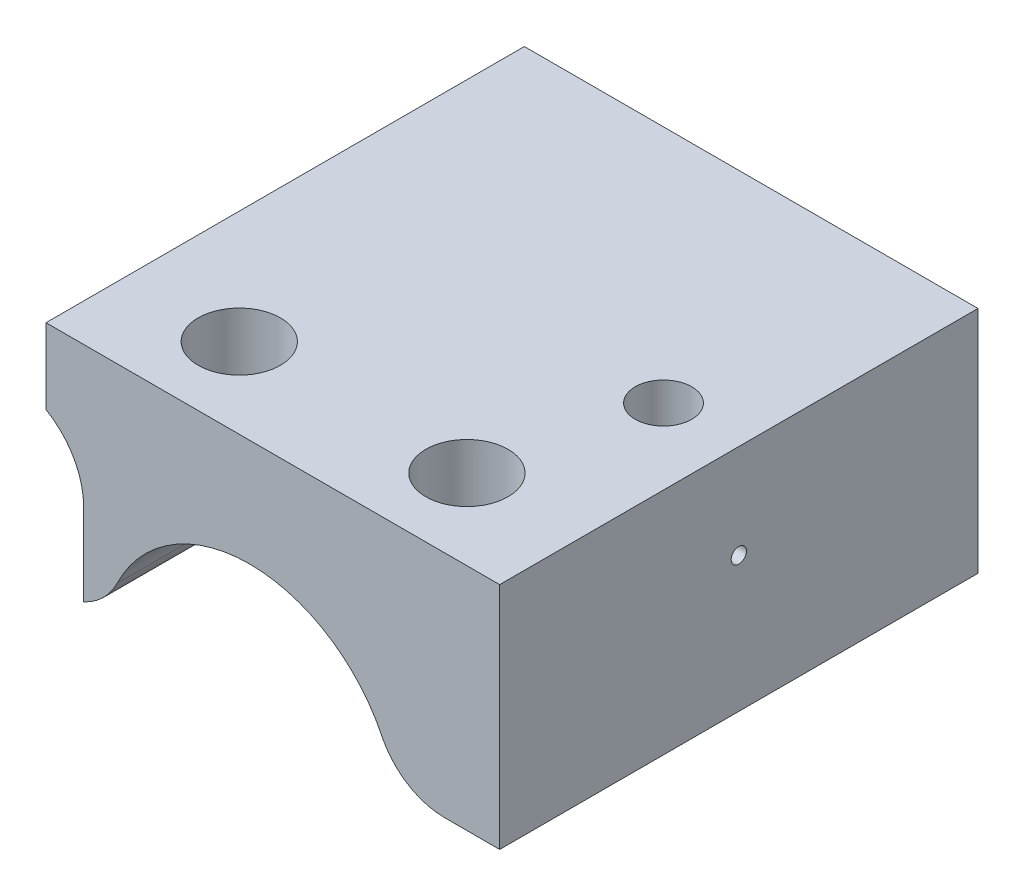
ISO-10303-21;
HEADER;
FILE_DESCRIPTION(('STEP AP214'),'2;1');
FILE_NAME('part.step','',(''),(''),'','','');
FILE_SCHEMA(('AUTOMOTIVE_DESIGN { 1 0 10303 214 1 1 1 1 }'));
ENDSEC;
DATA;
#1=APPLICATION_CONTEXT('core data for automotive mechanical design processes');
#2=APPLICATION_PROTOCOL_DEFINITION('international standard','automotive_design',2000,#1);
#3=PRODUCT_CONTEXT('',#1,'mechanical');
#4=PRODUCT('Part','Part','',(#3));
#5=PRODUCT_RELATED_PRODUCT_CATEGORY('part','',(#4));
#6=PRODUCT_DEFINITION_FORMATION('','',#4);
#7=PRODUCT_DEFINITION_CONTEXT('part definition',#1,'design');
#8=PRODUCT_DEFINITION('design','',#6,#7);
#9=PRODUCT_DEFINITION_SHAPE('','',#8);
#10=(LENGTH_UNIT() NAMED_UNIT(*) SI_UNIT(.MILLI.,.METRE.));
#11=(NAMED_UNIT(*) PLANE_ANGLE_UNIT() SI_UNIT($,.RADIAN.));
#12=(NAMED_UNIT(*) SI_UNIT($,.STERADIAN.) SOLID_ANGLE_UNIT());
#13=UNCERTAINTY_MEASURE_WITH_UNIT(LENGTH_MEASURE(1.E-05),#10,'distance_accuracy_value','');
#14=(GEOMETRIC_REPRESENTATION_CONTEXT(3) GLOBAL_UNCERTAINTY_ASSIGNED_CONTEXT((#13)) GLOBAL_UNIT_ASSIGNED_CONTEXT((#10,
#11,#12)) REPRESENTATION_CONTEXT('',''));
#15=CARTESIAN_POINT('',(0.,0.,0.));
#16=DIRECTION('',(0.,0.,1.));
#17=DIRECTION('',(1.,0.,0.));
#18=AXIS2_PLACEMENT_3D('',#15,#16,#17);
#19=CARTESIAN_POINT('',(-6.40299272,3.01794919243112,6.35));
#20=DIRECTION('',(0.,0.,-1.));
#21=DIRECTION('',(-1.,0.,0.));
#22=AXIS2_PLACEMENT_3D('',#19,#20,#21);
#23=CYLINDRICAL_SURFACE('',#22,2.);
#24=CARTESIAN_POINT('',(-6.40299272,3.01794919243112,-6.35));
#25=DIRECTION('',(0.,0.,-1.));
#26=DIRECTION('',(-1.,0.,0.));
#27=AXIS2_PLACEMENT_3D('',#24,#25,#26);
#28=CIRCLE('',#27,2.);
#29=CARTESIAN_POINT('',(-5.40299272,4.75,-6.35));
#30=VERTEX_POINT('',#29);
#31=CARTESIAN_POINT('',(-4.40299272,3.01794919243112,-6.35));
#32=VERTEX_POINT('',#31);
#33=EDGE_CURVE('E148',#30,#32,#28,.T.);
#34=ORIENTED_EDGE('',*,*,#33,.T.);
#35=DIRECTION('',(0.,0.,-1.));
#36=VECTOR('',#35,1.);
#37=CARTESIAN_POINT('',(-4.40299272,3.01794919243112,6.35));
#38=LINE('',#37,#36);
#39=CARTESIAN_POINT('',(-4.40299272,3.01794919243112,6.35));
#40=VERTEX_POINT('',#39);
#41=EDGE_CURVE('E11',#40,#32,#38,.T.);
#42=ORIENTED_EDGE('',*,*,#41,.F.);
#43=CARTESIAN_POINT('',(-6.40299272,3.01794919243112,6.35));
#44=DIRECTION('',(0.,0.,-1.));
#45=DIRECTION('',(-1.,0.,0.));
#46=AXIS2_PLACEMENT_3D('',#43,#44,#45);
#47=CIRCLE('',#46,2.);
#48=CARTESIAN_POINT('',(-5.40299272,4.75,6.35));
#49=VERTEX_POINT('',#48);
#50=EDGE_CURVE('E167',#49,#40,#47,.T.);
#51=ORIENTED_EDGE('',*,*,#50,.F.);
#52=DIRECTION('',(0.,0.,-1.));
#53=VECTOR('',#52,1.);
#54=CARTESIAN_POINT('',(-5.40299272,4.75,6.35));
#55=LINE('',#54,#53);
#56=EDGE_CURVE('E144',#49,#30,#55,.T.);
#57=ORIENTED_EDGE('',*,*,#56,.T.);
#58=EDGE_LOOP('',(#34,#42,#51,#57));
#59=FACE_BOUND('',#58,.T.);
#60=ADVANCED_FACE('F30',(#59),#23,.F.);
#61=CARTESIAN_POINT('',(-4.40299272,3.01794919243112,6.35));
#62=DIRECTION('',(1.,0.,0.));
#63=DIRECTION('',(0.,0.,-1.));
#64=AXIS2_PLACEMENT_3D('',#61,#62,#63);
#65=PLANE('',#64);
#66=DIRECTION('',(0.,-1.,0.));
#67=VECTOR('',#66,1.);
#68=CARTESIAN_POINT('',(-4.40299272,3.01794919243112,-6.35));
#69=LINE('',#68,#67);
#70=CARTESIAN_POINT('',(-4.40299272,0.830526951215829,-6.35));
#71=VERTEX_POINT('',#70);
#72=EDGE_CURVE('E151',#32,#71,#69,.T.);
#73=ORIENTED_EDGE('',*,*,#72,.T.);
#74=DIRECTION('',(0.,0.,-1.));
#75=VECTOR('',#74,1.);
#76=CARTESIAN_POINT('',(-4.40299272,0.830526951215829,6.35));
#77=LINE('',#76,#75);
#78=CARTESIAN_POINT('',(-4.40299272,0.830526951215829,6.35));
#79=VERTEX_POINT('',#78);
#80=EDGE_CURVE('E42',#79,#71,#77,.T.);
#81=ORIENTED_EDGE('',*,*,#80,.F.);
#82=DIRECTION('',(0.,-1.,0.));
#83=VECTOR('',#82,1.);
#84=CARTESIAN_POINT('',(-4.40299272,3.01794919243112,6.35));
#85=LINE('',#84,#83);
#86=EDGE_CURVE('E102',#40,#79,#85,.T.);
#87=ORIENTED_EDGE('',*,*,#86,.F.);
#88=ORIENTED_EDGE('',*,*,#41,.T.);
#89=EDGE_LOOP('',(#73,#81,#87,#88));
#90=FACE_BOUND('',#89,.T.);
#91=ADVANCED_FACE('F218',(#90),#65,.F.);
#92=CARTESIAN_POINT('',(-5.17879570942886,2.51000000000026,6.35));
#93=DIRECTION('',(0.,0.,-1.));
#94=DIRECTION('',(-1.,0.,0.));
#95=AXIS2_PLACEMENT_3D('',#92,#93,#94);
#96=CYLINDRICAL_SURFACE('',#95,1.85);
#97=CARTESIAN_POINT('',(-5.17879570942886,2.51000000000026,-6.35));
#98=DIRECTION('',(0.,0.,1.));
#99=DIRECTION('',(1.,0.,0.));
#100=AXIS2_PLACEMENT_3D('',#97,#98,#99);
#101=CIRCLE('',#100,1.85);
#102=CARTESIAN_POINT('',(-3.51402211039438,1.70313640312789,-6.35));
#103=VERTEX_POINT('',#102);
#104=EDGE_CURVE('E154',#71,#103,#101,.T.);
#105=ORIENTED_EDGE('',*,*,#104,.T.);
#106=DIRECTION('',(0.,0.,-1.));
#107=VECTOR('',#106,1.);
#108=CARTESIAN_POINT('',(-3.51402211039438,1.70313640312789,6.35));
#109=LINE('',#108,#107);
#110=CARTESIAN_POINT('',(-3.51402211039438,1.70313640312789,6.35));
#111=VERTEX_POINT('',#110);
#112=EDGE_CURVE('E178',#111,#103,#109,.T.);
#113=ORIENTED_EDGE('',*,*,#112,.F.);
#114=CARTESIAN_POINT('',(-5.17879570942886,2.51000000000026,6.35));
#115=DIRECTION('',(0.,0.,1.));
#116=DIRECTION('',(1.,0.,0.));
#117=AXIS2_PLACEMENT_3D('',#114,#115,#116);
#118=CIRCLE('',#117,1.85);
#119=EDGE_CURVE('E233',#79,#111,#118,.T.);
#120=ORIENTED_EDGE('',*,*,#119,.F.);
#121=ORIENTED_EDGE('',*,*,#80,.T.);
#122=EDGE_LOOP('',(#105,#113,#120,#121));
#123=FACE_BOUND('',#122,.T.);
#124=ADVANCED_FACE('F223',(#123),#96,.T.);
#125=CARTESIAN_POINT('',(0.,0.,6.35));
#126=DIRECTION('',(0.,0.,-1.));
#127=DIRECTION('',(-1.,0.,0.));
#128=AXIS2_PLACEMENT_3D('',#125,#126,#127);
#129=CYLINDRICAL_SURFACE('',#128,3.905);
#130=CARTESIAN_POINT('',(-3.49515607,1.74152491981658,4.21875));
#131=CARTESIAN_POINT('',(-3.49515256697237,1.74153330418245,4.24947455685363));
#132=CARTESIAN_POINT('',(-3.49384218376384,1.74416948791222,4.28024758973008));
#133=CARTESIAN_POINT('',(-3.4887451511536,1.75434077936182,4.34079670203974));
#134=CARTESIAN_POINT('',(-3.48495051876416,1.7618916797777,4.37056924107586));
#135=CARTESIAN_POINT('',(-3.47374043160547,1.78391279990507,4.43737537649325));
#136=CARTESIAN_POINT('',(-3.46556790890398,1.79980109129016,4.47380512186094));
#137=CARTESIAN_POINT('',(-3.44641010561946,1.83622145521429,4.54342750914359));
#138=CARTESIAN_POINT('',(-3.43541844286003,1.85676405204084,4.57661256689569));
#139=CARTESIAN_POINT('',(-3.40185804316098,1.91790215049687,4.66454407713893));
#140=CARTESIAN_POINT('',(-3.3769118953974,1.96171547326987,4.71610743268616));
#141=CARTESIAN_POINT('',(-3.32172965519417,2.05379216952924,4.81188727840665));
#142=CARTESIAN_POINT('',(-3.29147696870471,2.10206927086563,4.8560798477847));
#143=CARTESIAN_POINT('',(-3.2319164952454,2.19229201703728,4.93121458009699));
#144=CARTESIAN_POINT('',(-3.20333058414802,2.23390993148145,4.96313055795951));
#145=CARTESIAN_POINT('',(-3.14314849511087,2.31782636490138,5.02300008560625));
#146=CARTESIAN_POINT('',(-3.11155052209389,2.36012527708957,5.05095124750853));
#147=CARTESIAN_POINT('',(-3.01240816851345,2.48714805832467,5.12899966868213));
#148=CARTESIAN_POINT('',(-2.94045327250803,2.57209408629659,5.17336882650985));
#149=CARTESIAN_POINT('',(-2.79702911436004,2.72674180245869,5.23997087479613));
#150=CARTESIAN_POINT('',(-2.72704795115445,2.79684663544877,5.26450104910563));
#151=CARTESIAN_POINT('',(-2.57997573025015,2.93303991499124,5.29914350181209));
#152=CARTESIAN_POINT('',(-2.50289834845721,2.99913569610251,5.30928291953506));
#153=CARTESIAN_POINT('',(-2.36178776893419,3.11081147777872,5.31190237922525));
#154=CARTESIAN_POINT('',(-2.29880109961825,3.15762712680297,5.30788979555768));
#155=CARTESIAN_POINT('',(-2.17136052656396,3.24657111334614,5.28805292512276));
#156=CARTESIAN_POINT('',(-2.10690828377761,3.28870446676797,5.27224142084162));
#157=CARTESIAN_POINT('',(-1.98864986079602,3.36130504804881,5.23095573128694));
#158=CARTESIAN_POINT('',(-1.93470430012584,3.39257334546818,5.20729883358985));
#159=CARTESIAN_POINT('',(-1.82950413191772,3.45044023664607,5.15021594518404));
#160=CARTESIAN_POINT('',(-1.77824866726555,3.47704032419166,5.11679308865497));
#161=CARTESIAN_POINT('',(-1.68046661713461,3.52534417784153,5.04020220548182));
#162=CARTESIAN_POINT('',(-1.63396409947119,3.54702364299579,4.99698783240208));
#163=CARTESIAN_POINT('',(-1.54832867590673,3.58523495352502,4.90183469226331));
#164=CARTESIAN_POINT('',(-1.50919392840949,3.60176808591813,4.84989811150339));
#165=CARTESIAN_POINT('',(-1.44347469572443,3.62857478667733,4.74394341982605));
#166=CARTESIAN_POINT('',(-1.4160757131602,3.63927897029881,4.69053742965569));
#167=CARTESIAN_POINT('',(-1.37027126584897,3.65677273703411,4.57940471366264));
#168=CARTESIAN_POINT('',(-1.35186346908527,3.66356333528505,4.52167911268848));
#169=CARTESIAN_POINT('',(-1.32535254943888,3.67323532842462,4.40598571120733));
#170=CARTESIAN_POINT('',(-1.31687593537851,3.6762587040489,4.34811494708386));
#171=CARTESIAN_POINT('',(-1.30927620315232,3.67897242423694,4.23168648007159));
#172=CARTESIAN_POINT('',(-1.31015228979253,3.67866305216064,4.17312883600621));
#173=CARTESIAN_POINT('',(-1.32117816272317,3.67471712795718,4.05749423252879));
#174=CARTESIAN_POINT('',(-1.33125203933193,3.67110781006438,4.00040907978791));
#175=CARTESIAN_POINT('',(-1.36017963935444,3.660487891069,3.88884303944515));
#176=CARTESIAN_POINT('',(-1.37903297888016,3.65347743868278,3.83436203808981));
#177=CARTESIAN_POINT('',(-1.42483377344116,3.6358593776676,3.72940022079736));
#178=CARTESIAN_POINT('',(-1.45179882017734,3.62524394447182,3.67892840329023));
#179=CARTESIAN_POINT('',(-1.51272877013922,3.60024400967,3.58345190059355));
#180=CARTESIAN_POINT('',(-1.54669352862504,3.58585958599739,3.5384471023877));
#181=CARTESIAN_POINT('',(-1.62091563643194,3.55293250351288,3.45421115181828));
#182=CARTESIAN_POINT('',(-1.66127273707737,3.53432145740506,3.41509486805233));
#183=CARTESIAN_POINT('',(-1.74623160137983,3.49312574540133,3.34429340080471));
#184=CARTESIAN_POINT('',(-1.79083409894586,3.47054039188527,3.31260950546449));
#185=CARTESIAN_POINT('',(-1.88530098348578,3.42018810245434,3.25534063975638));
#186=CARTESIAN_POINT('',(-1.93532043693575,3.39219836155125,3.23020937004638));
#187=CARTESIAN_POINT('',(-2.03656293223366,3.33240144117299,3.18838018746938));
#188=CARTESIAN_POINT('',(-2.08778643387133,3.30059278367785,3.17168555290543));
#189=CARTESIAN_POINT('',(-2.19641862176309,3.22947182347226,3.14461936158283));
#190=CARTESIAN_POINT('',(-2.25379874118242,3.18971866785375,3.13530117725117));
#191=CARTESIAN_POINT('',(-2.36679328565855,3.10680651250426,3.12567411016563));
#192=CARTESIAN_POINT('',(-2.4224065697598,3.06364537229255,3.12537093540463));
#193=CARTESIAN_POINT('',(-2.55798138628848,2.9524193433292,3.134538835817));
#194=CARTESIAN_POINT('',(-2.6362454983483,2.88267432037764,3.1489625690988));
#195=CARTESIAN_POINT('',(-2.78489754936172,2.73936342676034,3.19256643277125));
#196=CARTESIAN_POINT('',(-2.85526312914,2.66578753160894,3.22178722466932));
#197=CARTESIAN_POINT('',(-2.98845832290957,2.5156236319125,3.29358966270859));
#198=CARTESIAN_POINT('',(-3.05112993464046,2.43900526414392,3.33640179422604));
#199=CARTESIAN_POINT('',(-3.1378755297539,2.3248772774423,3.40991115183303));
#200=CARTESIAN_POINT('',(-3.16555549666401,2.28700669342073,3.43593105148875));
#201=CARTESIAN_POINT('',(-3.21846087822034,2.21193039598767,3.49120793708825));
#202=CARTESIAN_POINT('',(-3.2436875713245,2.17472434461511,3.52046321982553));
#203=CARTESIAN_POINT('',(-3.29060218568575,2.10302744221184,3.58125368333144));
#204=CARTESIAN_POINT('',(-3.31239072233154,2.06848742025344,3.61265258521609));
#205=CARTESIAN_POINT('',(-3.35338488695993,2.00134494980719,3.67919858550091));
#206=CARTESIAN_POINT('',(-3.37258576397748,1.96874612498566,3.71435237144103));
#207=CARTESIAN_POINT('',(-3.40812519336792,1.9065679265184,3.7894595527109));
#208=CARTESIAN_POINT('',(-3.42442594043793,1.87703027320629,3.82946630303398));
#209=CARTESIAN_POINT('',(-3.45292868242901,1.82406327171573,3.91468705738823));
#210=CARTESIAN_POINT('',(-3.46514839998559,1.80060761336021,3.9598773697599));
#211=CARTESIAN_POINT('',(-3.47999167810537,1.77167426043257,4.03521092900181));
#212=CARTESIAN_POINT('',(-3.48448875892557,1.76278674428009,4.06365888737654));
#213=CARTESIAN_POINT('',(-3.49123276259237,1.74939338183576,4.1217882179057));
#214=CARTESIAN_POINT('',(-3.49348744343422,1.74487243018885,4.15146496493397));
#215=CARTESIAN_POINT('',(-3.49494280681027,1.74195264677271,4.19376967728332));
#216=CARTESIAN_POINT('',(-3.49515749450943,1.74152151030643,4.20625583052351));
#217=CARTESIAN_POINT('',(-3.49515607,1.74152491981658,4.21875));
#218=B_SPLINE_CURVE_WITH_KNOTS('',3,(#130,#131,#132,#133,#134,#135,#136,#137,#138,#139,#140,
#141,#142,#143,#144,#145,#146,#147,#148,#149,#150,#151,#152,#153,#154,#155,#156,#157,#158,#159,
#160,#161,#162,#163,#164,#165,#166,#167,#168,#169,#170,#171,#172,#173,#174,#175,#176,#177,#178,
#179,#180,#181,#182,#183,#184,#185,#186,#187,#188,#189,#190,#191,#192,#193,#194,#195,#196,#197,
#198,#199,#200,#201,#202,#203,#204,#205,#206,#207,#208,#209,#210,#211,#212,#213,#214,#215,#216,
#217),.UNSPECIFIED.,.T.,.F.,(4,2,2,2,2,2,2,2,2,2,2,2,2,2,2,2,2,2,2,2,2,2,2,2,2,2,2,2,2,2,2,2,2,
2,2,2,2,2,2,2,2,2,2,4),(0.,0.0921286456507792,0.184554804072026,0.305580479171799,
0.42688259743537,0.642036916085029,0.857876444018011,1.03683417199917,1.21589922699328,
1.57362030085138,1.87867658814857,2.18315680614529,2.41802568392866,2.65264048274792,
2.85186575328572,3.05102715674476,3.25115171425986,3.45122618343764,3.63322235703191,
3.8151713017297,3.99003229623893,4.16487842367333,4.33829445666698,4.51170290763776,
4.68549017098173,4.85927384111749,5.03609983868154,5.21295646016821,5.39995068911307,
5.58701752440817,5.79750573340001,6.00812721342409,6.32384497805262,6.64043506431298,
6.96270982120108,7.12351439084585,7.28423470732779,7.43858637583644,7.59321768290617,
7.74973674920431,7.90556698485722,7.99565387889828,8.0854280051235,8.12289220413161),.UNSPECIFIED.);
#219=CARTESIAN_POINT('',(-3.49515607,1.74152491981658,4.21875));
#220=VERTEX_POINT('',#219);
#221=EDGE_CURVE('E262',#220,#220,#218,.T.);
#222=ORIENTED_EDGE('',*,*,#221,.T.);
#223=EDGE_LOOP('',(#222));
#224=FACE_BOUND('',#223,.T.);
#225=DIRECTION('',(0.,0.,-1.));
#226=VECTOR('',#225,1.);
#227=CARTESIAN_POINT('',(3.51402211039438,1.70313640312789,6.35));
#228=LINE('',#227,#226);
#229=CARTESIAN_POINT('',(3.51402211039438,1.70313640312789,3.13401145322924));
#230=VERTEX_POINT('',#229);
#231=CARTESIAN_POINT('',(3.51402211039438,1.70313640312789,-6.35));
#232=VERTEX_POINT('',#231);
#233=EDGE_CURVE('E174',#230,#232,#228,.T.);
#234=ORIENTED_EDGE('',*,*,#233,.F.);
#235=CARTESIAN_POINT('',(3.84882124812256,0.660000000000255,3.14641303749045));
#236=CARTESIAN_POINT('',(3.84107131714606,0.70519351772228,3.14491694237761));
#237=CARTESIAN_POINT('',(3.83252659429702,0.750244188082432,3.14334912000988));
#238=CARTESIAN_POINT('',(3.81385616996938,0.840016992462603,3.14019785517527));
#239=CARTESIAN_POINT('',(3.80373044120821,0.884739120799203,3.13861441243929));
#240=CARTESIAN_POINT('',(3.77096531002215,1.01846766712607,3.13402832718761));
#241=CARTESIAN_POINT('',(3.74595916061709,1.10691263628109,3.13119471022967));
#242=CARTESIAN_POINT('',(3.68947619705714,1.28273208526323,3.12723461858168));
#243=CARTESIAN_POINT('',(3.65793707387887,1.37008696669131,3.12612552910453));
#244=CARTESIAN_POINT('',(3.58874423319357,1.54225059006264,3.12727543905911));
#245=CARTESIAN_POINT('',(3.55109581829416,1.62706146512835,3.12953153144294));
#246=CARTESIAN_POINT('',(3.46415181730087,1.80551403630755,3.14002486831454));
#247=CARTESIAN_POINT('',(3.41396037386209,1.89868097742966,3.14907241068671));
#248=CARTESIAN_POINT('',(3.30702211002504,2.07932037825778,3.17754963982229));
#249=CARTESIAN_POINT('',(3.25029491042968,2.16680870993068,3.19694885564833));
#250=CARTESIAN_POINT('',(3.14427584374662,2.31716106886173,3.24491219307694));
#251=CARTESIAN_POINT('',(3.09580174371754,2.38142585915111,3.27082794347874));
#252=CARTESIAN_POINT('',(2.99804527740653,2.50335956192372,3.33428064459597));
#253=CARTESIAN_POINT('',(2.94876424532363,2.56103830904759,3.37179994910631));
#254=CARTESIAN_POINT('',(2.86612241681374,2.65274821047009,3.44806311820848));
#255=CARTESIAN_POINT('',(2.83214123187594,2.68889809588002,3.48357307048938));
#256=CARTESIAN_POINT('',(2.76730853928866,2.75557270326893,3.56200028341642));
#257=CARTESIAN_POINT('',(2.73645355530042,2.78610370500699,3.60490916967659));
#258=CARTESIAN_POINT('',(2.68422760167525,2.8363821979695,3.6908124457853));
#259=CARTESIAN_POINT('',(2.66212806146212,2.85706194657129,3.73281485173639));
#260=CARTESIAN_POINT('',(2.62300895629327,2.89301863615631,3.82129306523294));
#261=CARTESIAN_POINT('',(2.60598791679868,2.90829714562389,3.86776756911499));
#262=CARTESIAN_POINT('',(2.57813489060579,2.93301869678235,3.96428672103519));
#263=CARTESIAN_POINT('',(2.56733251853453,2.94243383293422,4.01434719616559));
#264=CARTESIAN_POINT('',(2.55287412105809,2.95498797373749,4.11626141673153));
#265=CARTESIAN_POINT('',(2.54921602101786,2.95812880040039,4.16811463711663));
#266=CARTESIAN_POINT('',(2.54932177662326,2.95803658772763,4.26730153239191));
#267=CARTESIAN_POINT('',(2.5524710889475,2.95533131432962,4.31463822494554));
#268=CARTESIAN_POINT('',(2.56474863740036,2.94468243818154,4.40791194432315));
#269=CARTESIAN_POINT('',(2.57387572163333,2.93673984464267,4.45384923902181));
#270=CARTESIAN_POINT('',(2.59745533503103,2.91590358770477,4.54285176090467));
#271=CARTESIAN_POINT('',(2.61187776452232,2.90303789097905,4.58593162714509));
#272=CARTESIAN_POINT('',(2.64520511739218,2.87270271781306,4.6685758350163));
#273=CARTESIAN_POINT('',(2.66411101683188,2.85523223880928,4.70813940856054));
#274=CARTESIAN_POINT('',(2.7071591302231,2.81447339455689,4.78630426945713));
#275=CARTESIAN_POINT('',(2.73160819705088,2.79081903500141,4.82454407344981));
#276=CARTESIAN_POINT('',(2.78333928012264,2.73923108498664,4.89584382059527));
#277=CARTESIAN_POINT('',(2.81062294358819,2.71129500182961,4.9289007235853));
#278=CARTESIAN_POINT('',(2.88126456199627,2.63650232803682,5.00546292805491));
#279=CARTESIAN_POINT('',(2.92570521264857,2.58727770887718,5.04566182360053));
#280=CARTESIAN_POINT('',(3.01524891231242,2.48235385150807,5.11540248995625));
#281=CARTESIAN_POINT('',(3.06035299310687,2.42664332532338,5.14492530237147));
#282=CARTESIAN_POINT('',(3.13822204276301,2.32457546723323,5.18886319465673));
#283=CARTESIAN_POINT('',(3.17130707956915,2.27926261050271,5.20520726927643));
#284=CARTESIAN_POINT('',(3.23608290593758,2.18632285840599,5.23354566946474));
#285=CARTESIAN_POINT('',(3.26777292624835,2.13869471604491,5.24553762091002));
#286=CARTESIAN_POINT('',(3.36042983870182,1.99245026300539,5.27619178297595));
#287=CARTESIAN_POINT('',(3.41864223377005,1.89091765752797,5.289359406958));
#288=CARTESIAN_POINT('',(3.5180648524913,1.69774034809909,5.30494167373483));
#289=CARTESIAN_POINT('',(3.56051651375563,1.60680431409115,5.30864136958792));
#290=CARTESIAN_POINT('',(3.6383596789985,1.42177316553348,5.31164044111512));
#291=CARTESIAN_POINT('',(3.67374283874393,1.3276744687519,5.31093464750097));
#292=CARTESIAN_POINT('',(3.73654944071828,1.13883552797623,5.30724997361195));
#293=CARTESIAN_POINT('',(3.76410736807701,1.04413894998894,5.30431315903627));
#294=CARTESIAN_POINT('',(3.79998338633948,0.900871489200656,5.29945268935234));
#295=CARTESIAN_POINT('',(3.81102376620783,0.852959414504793,5.29775853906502));
#296=CARTESIAN_POINT('',(3.83128778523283,0.756753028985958,5.29437747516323));
#297=CARTESIAN_POINT('',(3.84051144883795,0.708458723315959,5.29269056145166));
#298=CARTESIAN_POINT('',(3.84882124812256,0.660000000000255,5.29108696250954));
#299=B_SPLINE_CURVE_WITH_KNOTS('',3,(#235,#236,#237,#238,#239,#240,#241,#242,#243,#244,#245,
#246,#247,#248,#249,#250,#251,#252,#253,#254,#255,#256,#257,#258,#259,#260,#261,#262,#263,#264,
#265,#266,#267,#268,#269,#270,#271,#272,#273,#274,#275,#276,#277,#278,#279,#280,#281,#282,#283,
#284,#285,#286,#287,#288,#289,#290,#291,#292,#293,#294,#295,#296,#297,#298),.UNSPECIFIED.,.F.,
.F.,(4,2,2,2,2,2,2,2,2,2,2,2,2,2,2,2,2,2,2,2,2,2,2,2,2,2,2,2,2,2,2,4),(0.,0.13761752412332,
0.275237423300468,0.550852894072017,0.829229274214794,1.10736531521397,1.425333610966,
1.74237106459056,1.99526453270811,2.24777528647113,2.43015848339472,2.61233659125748,
2.76699592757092,2.92161031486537,3.07695504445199,3.2322546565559,3.37412279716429,
3.51596360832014,3.6570103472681,3.79808782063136,3.9510434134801,4.10408839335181,
4.33542904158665,4.56717850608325,4.74225302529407,4.91742290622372,5.26949998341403,
5.57038767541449,5.87162848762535,6.16732621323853,6.314886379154,6.46244455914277),.UNSPECIFIED.);
#300=CARTESIAN_POINT('',(3.51402211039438,1.70313640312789,5.30348854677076));
#301=VERTEX_POINT('',#300);
#302=EDGE_CURVE('E49',#230,#301,#299,.T.);
#303=ORIENTED_EDGE('',*,*,#302,.T.);
#304=CARTESIAN_POINT('',(3.51402211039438,1.70313640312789,6.35));
#305=VERTEX_POINT('',#304);
#306=EDGE_CURVE('E175',#305,#301,#228,.T.);
#307=ORIENTED_EDGE('',*,*,#306,.F.);
#308=CARTESIAN_POINT('',(0.,0.,6.35));
#309=DIRECTION('',(0.,0.,-1.));
#310=DIRECTION('',(1.,0.,0.));
#311=AXIS2_PLACEMENT_3D('',#308,#309,#310);
#312=CIRCLE('',#311,3.905);
#313=EDGE_CURVE('E235',#111,#305,#312,.T.);
#314=ORIENTED_EDGE('',*,*,#313,.F.);
#315=ORIENTED_EDGE('',*,*,#112,.T.);
#316=CARTESIAN_POINT('',(0.,0.,-6.35));
#317=DIRECTION('',(0.,0.,-1.));
#318=DIRECTION('',(1.,0.,0.));
#319=AXIS2_PLACEMENT_3D('',#316,#317,#318);
#320=CIRCLE('',#319,3.905);
#321=EDGE_CURVE('E156',#103,#232,#320,.T.);
#322=ORIENTED_EDGE('',*,*,#321,.T.);
#323=EDGE_LOOP('',(#234,#303,#307,#314,#315,#322));
#324=FACE_BOUND('',#323,.T.);
#325=ADVANCED_FACE('F270',(#224,#324),#129,.F.);
#326=CARTESIAN_POINT('',(5.17879570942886,2.51000000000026,6.35));
#327=DIRECTION('',(0.,0.,-1.));
#328=DIRECTION('',(-1.,0.,0.));
#329=AXIS2_PLACEMENT_3D('',#326,#327,#328);
#330=CYLINDRICAL_SURFACE('',#329,1.85);
#331=ORIENTED_EDGE('',*,*,#306,.T.);
#332=CARTESIAN_POINT('',(3.32879570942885,2.51000000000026,5.26523709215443));
#333=CARTESIAN_POINT('',(3.32879825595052,2.41760659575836,5.26524412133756));
#334=CARTESIAN_POINT('',(3.33573870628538,2.32518685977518,5.26738934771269));
#335=CARTESIAN_POINT('',(3.36331461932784,2.14245540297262,5.27502827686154));
#336=CARTESIAN_POINT('',(3.38397091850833,2.05214710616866,5.28052707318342));
#337=CARTESIAN_POINT('',(3.44122727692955,1.86681484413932,5.29287621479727));
#338=CARTESIAN_POINT('',(3.4792169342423,1.77222441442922,5.29980676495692));
#339=CARTESIAN_POINT('',(3.57033981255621,1.59039612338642,5.30958988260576));
#340=CARTESIAN_POINT('',(3.62345676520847,1.50315049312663,5.31244681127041));
#341=CARTESIAN_POINT('',(3.72643711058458,1.36172647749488,5.30849215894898));
#342=CARTESIAN_POINT('',(3.77305934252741,1.30512205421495,5.30416005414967));
#343=CARTESIAN_POINT('',(3.87202205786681,1.19847386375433,5.28751215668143));
#344=CARTESIAN_POINT('',(3.92435209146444,1.14841846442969,5.27521075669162));
#345=CARTESIAN_POINT('',(4.02317184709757,1.06414159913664,5.24316141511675));
#346=CARTESIAN_POINT('',(4.06912571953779,1.02867667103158,5.22505074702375));
#347=CARTESIAN_POINT('',(4.16140156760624,0.963849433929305,5.18061695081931));
#348=CARTESIAN_POINT('',(4.20772336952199,0.934484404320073,5.15429749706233));
#349=CARTESIAN_POINT('',(4.29848170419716,0.882022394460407,5.09296188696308));
#350=CARTESIAN_POINT('',(4.34290964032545,0.858951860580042,5.05791018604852));
#351=CARTESIAN_POINT('',(4.42711631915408,0.818947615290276,4.97964683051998));
#352=CARTESIAN_POINT('',(4.46689467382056,0.802014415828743,4.936434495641));
#353=CARTESIAN_POINT('',(4.53698315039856,0.774518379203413,4.84642716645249));
#354=CARTESIAN_POINT('',(4.567767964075,0.763585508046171,4.80011201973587));
#355=CARTESIAN_POINT('',(4.62215112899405,0.745497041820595,4.70277002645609));
#356=CARTESIAN_POINT('',(4.64574913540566,0.738341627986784,4.65174295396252));
#357=CARTESIAN_POINT('',(4.68524393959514,0.726929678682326,4.54542026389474));
#358=CARTESIAN_POINT('',(4.70099276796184,0.722728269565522,4.49006386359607));
#359=CARTESIAN_POINT('',(4.72360778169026,0.716834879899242,4.37743479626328));
#360=CARTESIAN_POINT('',(4.73047265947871,0.715143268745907,4.32016184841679));
#361=CARTESIAN_POINT('',(4.73516821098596,0.713976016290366,4.20352747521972));
#362=CARTESIAN_POINT('',(4.73272666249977,0.714567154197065,4.14415424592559));
#363=CARTESIAN_POINT('',(4.71827339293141,0.718220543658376,4.02665413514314));
#364=CARTESIAN_POINT('',(4.70626061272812,0.721283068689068,3.96852739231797));
#365=CARTESIAN_POINT('',(4.67300388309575,0.730401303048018,3.85494304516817));
#366=CARTESIAN_POINT('',(4.65172068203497,0.736469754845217,3.79949791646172));
#367=CARTESIAN_POINT('',(4.60073667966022,0.752428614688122,3.69322185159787));
#368=CARTESIAN_POINT('',(4.57103807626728,0.762318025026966,3.64238971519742));
#369=CARTESIAN_POINT('',(4.50531439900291,0.786597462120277,3.54800105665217));
#370=CARTESIAN_POINT('',(4.46945227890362,0.800877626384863,3.50430297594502));
#371=CARTESIAN_POINT('',(4.39270259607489,0.834795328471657,3.42399600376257));
#372=CARTESIAN_POINT('',(4.35181697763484,0.85443079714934,3.38738438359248));
#373=CARTESIAN_POINT('',(4.2684081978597,0.898833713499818,3.32289894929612));
#374=CARTESIAN_POINT('',(4.22596937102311,0.9234319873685,3.29479850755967));
#375=CARTESIAN_POINT('',(4.14040544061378,0.978065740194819,3.24592129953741));
#376=CARTESIAN_POINT('',(4.09728022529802,1.00810211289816,3.22514573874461));
#377=CARTESIAN_POINT('',(4.01018469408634,1.074733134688,3.18954212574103));
#378=CARTESIAN_POINT('',(3.96626839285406,1.11156787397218,3.17503571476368));
#379=CARTESIAN_POINT('',(3.88124373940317,1.19006828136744,3.1522834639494));
#380=CARTESIAN_POINT('',(3.84013742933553,1.23173740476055,3.14404213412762));
#381=CARTESIAN_POINT('',(3.74175652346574,1.34155256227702,3.12951604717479));
#382=CARTESIAN_POINT('',(3.68696120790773,1.41234290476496,3.12638611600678));
#383=CARTESIAN_POINT('',(3.58815686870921,1.56110920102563,3.12672788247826));
#384=CARTESIAN_POINT('',(3.54417152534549,1.63910042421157,3.13021392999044));
#385=CARTESIAN_POINT('',(3.46704417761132,1.8023641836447,3.13985225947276));
#386=CARTESIAN_POINT('',(3.43418384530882,1.8877654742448,3.14606576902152));
#387=CARTESIAN_POINT('',(3.38141921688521,2.06250628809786,3.15761175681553));
#388=CARTESIAN_POINT('',(3.36150475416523,2.15184266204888,3.16294492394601));
#389=CARTESIAN_POINT('',(3.340754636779,2.29363005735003,3.16873917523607));
#390=CARTESIAN_POINT('',(3.33539669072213,2.34541140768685,3.17030923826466));
#391=CARTESIAN_POINT('',(3.32906117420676,2.44927868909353,3.17217724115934));
#392=CARTESIAN_POINT('',(3.32808394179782,2.50136464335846,3.17247508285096));
#393=CARTESIAN_POINT('',(3.33052614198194,2.60545173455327,3.17174664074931));
#394=CARTESIAN_POINT('',(3.33394791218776,2.65745281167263,3.17071965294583));
#395=CARTESIAN_POINT('',(3.34515336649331,2.76093178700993,3.16749936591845));
#396=CARTESIAN_POINT('',(3.3529369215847,2.81240970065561,3.16530610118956));
#397=CARTESIAN_POINT('',(3.38202336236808,2.96181378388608,3.15761808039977));
#398=CARTESIAN_POINT('',(3.40917073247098,3.05859884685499,3.15094698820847));
#399=CARTESIAN_POINT('',(3.47877404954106,3.24652846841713,3.13816265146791));
#400=CARTESIAN_POINT('',(3.52123113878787,3.33767260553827,3.13204944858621));
#401=CARTESIAN_POINT('',(3.61175652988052,3.49678024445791,3.12618591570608));
#402=CARTESIAN_POINT('',(3.65753788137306,3.56600704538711,3.12550832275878));
#403=CARTESIAN_POINT('',(3.75780025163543,3.69746030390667,3.13160765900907));
#404=CARTESIAN_POINT('',(3.81226364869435,3.75970051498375,3.13836964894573));
#405=CARTESIAN_POINT('',(3.91475202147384,3.86229928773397,3.16030361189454));
#406=CARTESIAN_POINT('',(3.96147012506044,3.90443088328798,3.17324208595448));
#407=CARTESIAN_POINT('',(4.05708095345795,3.98242982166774,3.20744446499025));
#408=CARTESIAN_POINT('',(4.10597220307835,4.01830133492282,3.22870279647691));
#409=CARTESIAN_POINT('',(4.20377934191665,4.08331383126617,3.28077644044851));
#410=CARTESIAN_POINT('',(4.25269312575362,4.11240725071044,3.31165593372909));
#411=CARTESIAN_POINT('',(4.34715073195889,4.16340655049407,3.38303859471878));
#412=CARTESIAN_POINT('',(4.3926954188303,4.18531427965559,3.42353928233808));
#413=CARTESIAN_POINT('',(4.47276217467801,4.22047374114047,3.50820821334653));
#414=CARTESIAN_POINT('',(4.50794665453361,4.23441659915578,3.55146956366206));
#415=CARTESIAN_POINT('',(4.57170767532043,4.25788477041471,3.6436836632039));
#416=CARTESIAN_POINT('',(4.60028403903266,4.26740996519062,3.69263656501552));
#417=CARTESIAN_POINT('',(4.64948787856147,4.28285007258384,3.79450527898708));
#418=CARTESIAN_POINT('',(4.67016480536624,4.28878758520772,3.84739387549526));
#419=CARTESIAN_POINT('',(4.70310114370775,4.29787799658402,3.95595625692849));
#420=CARTESIAN_POINT('',(4.71535962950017,4.30103058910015,4.01163034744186));
#421=CARTESIAN_POINT('',(4.73132713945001,4.30508889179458,4.12618257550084));
#422=CARTESIAN_POINT('',(4.73473560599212,4.30591569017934,4.18510554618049));
#423=CARTESIAN_POINT('',(4.73202573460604,4.30524314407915,4.30272551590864));
#424=CARTESIAN_POINT('',(4.72590594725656,4.3037434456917,4.36142247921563));
#425=CARTESIAN_POINT('',(4.70420112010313,4.29812377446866,4.47767789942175));
#426=CARTESIAN_POINT('',(4.68849899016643,4.29397135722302,4.53521302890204));
#427=CARTESIAN_POINT('',(4.64809302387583,4.28236948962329,4.64668064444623));
#428=CARTESIAN_POINT('',(4.62339020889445,4.27492041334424,4.70061353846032));
#429=CARTESIAN_POINT('',(4.56641199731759,4.25595820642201,4.8024780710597));
#430=CARTESIAN_POINT('',(4.53425362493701,4.24450661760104,4.85048647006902));
#431=CARTESIAN_POINT('',(4.46365436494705,4.21660671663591,4.93997046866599));
#432=CARTESIAN_POINT('',(4.42521633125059,4.20016067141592,4.98144901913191));
#433=CARTESIAN_POINT('',(4.34541125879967,4.16222597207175,5.05554969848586));
#434=CARTESIAN_POINT('',(4.30418818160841,4.14092771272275,5.08842493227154));
#435=CARTESIAN_POINT('',(4.21978103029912,4.09276636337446,5.14669933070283));
#436=CARTESIAN_POINT('',(4.17659697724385,4.0659033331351,5.1720985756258));
#437=CARTESIAN_POINT('',(4.08972584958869,4.00640662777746,5.21593072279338));
#438=CARTESIAN_POINT('',(4.04603963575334,3.97370164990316,5.23426752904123));
#439=CARTESIAN_POINT('',(3.96047402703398,3.90329561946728,5.26431139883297));
#440=CARTESIAN_POINT('',(3.91859575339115,3.86559152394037,5.27601440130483));
#441=CARTESIAN_POINT('',(3.82010542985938,3.76822337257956,5.29788934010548));
#442=CARTESIAN_POINT('',(3.76515291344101,3.7062141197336,5.30510334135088));
#443=CARTESIAN_POINT('',(3.66388466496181,3.57510685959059,5.31190561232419));
#444=CARTESIAN_POINT('',(3.61758746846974,3.50599411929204,5.31147770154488));
#445=CARTESIAN_POINT('',(3.53375099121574,3.36060976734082,5.30645459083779));
#446=CARTESIAN_POINT('',(3.49644876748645,3.28420608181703,5.30175954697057));
#447=CARTESIAN_POINT('',(3.43271233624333,3.12714778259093,5.29130139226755));
#448=CARTESIAN_POINT('',(3.40626923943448,3.04649670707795,5.28553916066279));
#449=CARTESIAN_POINT('',(3.36668777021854,2.89027205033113,5.2759956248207));
#450=CARTESIAN_POINT('',(3.35250238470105,2.81497164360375,5.27207583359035));
#451=CARTESIAN_POINT('',(3.33355637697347,2.66311999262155,5.26669393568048));
#452=CARTESIAN_POINT('',(3.32879359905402,2.58656903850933,5.2652312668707));
#453=CARTESIAN_POINT('',(3.32879570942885,2.51000000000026,5.26523709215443));
#454=B_SPLINE_CURVE_WITH_KNOTS('',3,(#332,#333,#334,#335,#336,#337,#338,#339,#340,#341,#342,
#343,#344,#345,#346,#347,#348,#349,#350,#351,#352,#353,#354,#355,#356,#357,#358,#359,#360,#361,
#362,#363,#364,#365,#366,#367,#368,#369,#370,#371,#372,#373,#374,#375,#376,#377,#378,#379,#380,
#381,#382,#383,#384,#385,#386,#387,#388,#389,#390,#391,#392,#393,#394,#395,#396,#397,#398,#399,
#400,#401,#402,#403,#404,#405,#406,#407,#408,#409,#410,#411,#412,#413,#414,#415,#416,#417,#418,
#419,#420,#421,#422,#423,#424,#425,#426,#427,#428,#429,#430,#431,#432,#433,#434,#435,#436,#437,
#438,#439,#440,#441,#442,#443,#444,#445,#446,#447,#448,#449,#450,#451,#452,#453),.UNSPECIFIED.,
.T.,.F.,(4,2,2,2,2,2,2,2,2,2,2,2,2,2,2,2,2,2,2,2,2,2,2,2,2,2,2,2,2,2,2,2,2,2,2,2,2,2,2,2,2,2,2,
2,2,2,2,2,2,2,2,2,2,2,2,2,2,2,2,2,4),(0.,0.276950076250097,0.554321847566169,0.859472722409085,
1.16429666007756,1.38391053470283,1.60312888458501,1.78478173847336,1.96635339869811,
2.148676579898,2.33101496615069,2.50026438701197,2.66952192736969,2.84185977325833,
3.01422298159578,3.19166613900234,3.36912893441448,3.54735053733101,3.72552563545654,
3.89956256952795,4.07353235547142,4.24235088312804,4.4111971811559,4.58789826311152,
4.76472642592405,5.03196544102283,5.29978475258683,5.57395094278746,5.84790156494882,
6.00397064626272,6.16005177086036,6.31621587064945,6.47237535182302,6.77317401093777,
7.07399511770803,7.32210291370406,7.56971339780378,7.76163472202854,7.95342769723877,
8.14652851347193,8.3395796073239,8.51119005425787,8.6828051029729,8.85332750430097,
9.02386865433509,9.20013009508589,9.37641835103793,9.55490511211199,9.73337162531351,
9.90920674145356,10.0849621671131,10.2547437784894,10.4245235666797,10.5965381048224,
10.7686578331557,11.0167799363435,11.2654274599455,11.5200470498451,11.7744577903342,
12.004026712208,12.2335431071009),.UNSPECIFIED.);
#455=EDGE_CURVE('E283',#301,#230,#454,.T.);
#456=ORIENTED_EDGE('',*,*,#455,.T.);
#457=ORIENTED_EDGE('',*,*,#233,.T.);
#458=CARTESIAN_POINT('',(5.17879570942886,2.51000000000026,-6.35));
#459=DIRECTION('',(0.,0.,1.));
#460=DIRECTION('',(1.,0.,0.));
#461=AXIS2_PLACEMENT_3D('',#458,#459,#460);
#462=CIRCLE('',#461,1.85);
#463=CARTESIAN_POINT('',(5.17879570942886,0.660000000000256,-6.35));
#464=VERTEX_POINT('',#463);
#465=EDGE_CURVE('E159',#232,#464,#462,.T.);
#466=ORIENTED_EDGE('',*,*,#465,.T.);
#467=DIRECTION('',(0.,0.,-1.));
#468=VECTOR('',#467,1.);
#469=CARTESIAN_POINT('',(5.17879570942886,0.660000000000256,6.35));
#470=LINE('',#469,#468);
#471=CARTESIAN_POINT('',(5.17879570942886,0.660000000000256,6.35));
#472=VERTEX_POINT('',#471);
#473=EDGE_CURVE('E171',#472,#464,#470,.T.);
#474=ORIENTED_EDGE('',*,*,#473,.F.);
#475=CARTESIAN_POINT('',(5.17879570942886,2.51000000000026,6.35));
#476=DIRECTION('',(0.,0.,1.));
#477=DIRECTION('',(1.,0.,0.));
#478=AXIS2_PLACEMENT_3D('',#475,#476,#477);
#479=CIRCLE('',#478,1.85);
#480=EDGE_CURVE('E237',#305,#472,#479,.T.);
#481=ORIENTED_EDGE('',*,*,#480,.F.);
#482=EDGE_LOOP('',(#331,#456,#457,#466,#474,#481));
#483=FACE_BOUND('',#482,.T.);
#484=ADVANCED_FACE('F246',(#483),#330,.T.);
#485=CARTESIAN_POINT('',(5.17879570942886,0.660000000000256,6.35));
#486=DIRECTION('',(0.,1.,0.));
#487=DIRECTION('',(-1.,0.,0.));
#488=AXIS2_PLACEMENT_3D('',#485,#486,#487);
#489=PLANE('',#488);
#490=DIRECTION('',(1.,0.,0.));
#491=VECTOR('',#490,1.);
#492=CARTESIAN_POINT('',(5.17879570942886,0.660000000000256,-6.35));
#493=LINE('',#492,#491);
#494=CARTESIAN_POINT('',(6.64150728,0.660000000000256,-6.35));
#495=VERTEX_POINT('',#494);
#496=EDGE_CURVE('E161',#464,#495,#493,.T.);
#497=ORIENTED_EDGE('',*,*,#496,.T.);
#498=DIRECTION('',(0.,0.,-1.));
#499=VECTOR('',#498,1.);
#500=CARTESIAN_POINT('',(6.64150728,0.660000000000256,6.35));
#501=LINE('',#500,#499);
#502=CARTESIAN_POINT('',(6.64150728,0.660000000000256,6.35));
#503=VERTEX_POINT('',#502);
#504=EDGE_CURVE('E139',#503,#495,#501,.T.);
#505=ORIENTED_EDGE('',*,*,#504,.F.);
#506=DIRECTION('',(1.,0.,0.));
#507=VECTOR('',#506,1.);
#508=CARTESIAN_POINT('',(5.17879570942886,0.660000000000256,6.35));
#509=LINE('',#508,#507);
#510=EDGE_CURVE('E127',#472,#503,#509,.T.);
#511=ORIENTED_EDGE('',*,*,#510,.F.);
#512=ORIENTED_EDGE('',*,*,#473,.T.);
#513=EDGE_LOOP('',(#497,#505,#511,#512));
#514=FACE_BOUND('',#513,.T.);
#515=ADVANCED_FACE('F250',(#514),#489,.F.);
#516=CARTESIAN_POINT('',(6.64150728,0.660000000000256,6.35));
#517=DIRECTION('',(-1.,0.,0.));
#518=DIRECTION('',(0.,0.,1.));
#519=AXIS2_PLACEMENT_3D('',#516,#517,#518);
#520=PLANE('',#519);
#521=CARTESIAN_POINT('',(6.64150728,4.25,0.));
#522=DIRECTION('',(1.,0.,0.));
#523=DIRECTION('',(0.,0.,-1.));
#524=AXIS2_PLACEMENT_3D('',#521,#522,#523);
#525=CIRCLE('',#524,0.203199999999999);
#526=CARTESIAN_POINT('',(6.64150728,4.25,-0.203199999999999));
#527=VERTEX_POINT('',#526);
#528=EDGE_CURVE('E259',#527,#527,#525,.T.);
#529=ORIENTED_EDGE('',*,*,#528,.F.);
#530=EDGE_LOOP('',(#529));
#531=FACE_BOUND('',#530,.T.);
#532=DIRECTION('',(0.,1.,0.));
#533=VECTOR('',#532,1.);
#534=CARTESIAN_POINT('',(6.64150728,0.660000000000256,-6.35));
#535=LINE('',#534,#533);
#536=CARTESIAN_POINT('',(6.64150728,6.75,-6.35));
#537=VERTEX_POINT('',#536);
#538=EDGE_CURVE('E136',#495,#537,#535,.T.);
#539=ORIENTED_EDGE('',*,*,#538,.T.);
#540=DIRECTION('',(0.,0.,-1.));
#541=VECTOR('',#540,1.);
#542=CARTESIAN_POINT('',(6.64150728,6.75,6.35));
#543=LINE('',#542,#541);
#544=CARTESIAN_POINT('',(6.64150728,6.75,6.35));
#545=VERTEX_POINT('',#544);
#546=EDGE_CURVE('E133',#545,#537,#543,.T.);
#547=ORIENTED_EDGE('',*,*,#546,.F.);
#548=DIRECTION('',(0.,1.,0.));
#549=VECTOR('',#548,1.);
#550=CARTESIAN_POINT('',(6.64150728,0.660000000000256,6.35));
#551=LINE('',#550,#549);
#552=EDGE_CURVE('E120',#503,#545,#551,.T.);
#553=ORIENTED_EDGE('',*,*,#552,.F.);
#554=ORIENTED_EDGE('',*,*,#504,.T.);
#555=EDGE_LOOP('',(#539,#547,#553,#554));
#556=FACE_BOUND('',#555,.T.);
#557=ADVANCED_FACE('F134',(#531,#556),#520,.F.);
#558=CARTESIAN_POINT('',(6.64150728,6.75,6.35));
#559=DIRECTION('',(0.,-1.,0.));
#560=DIRECTION('',(1.,0.,0.));
#561=AXIS2_PLACEMENT_3D('',#558,#559,#560);
#562=PLANE('',#561);
#563=CARTESIAN_POINT('',(3.64147063,6.75,4.21875));
#564=DIRECTION('',(0.,1.,0.));
#565=DIRECTION('',(1.,0.,0.));
#566=AXIS2_PLACEMENT_3D('',#563,#564,#565);
#567=CIRCLE('',#566,1.0922);
#568=CARTESIAN_POINT('',(4.73367063,6.75,4.21875));
#569=VERTEX_POINT('',#568);
#570=EDGE_CURVE('E298',#569,#569,#567,.T.);
#571=ORIENTED_EDGE('',*,*,#570,.F.);
#572=EDGE_LOOP('',(#571));
#573=FACE_BOUND('',#572,.T.);
#574=CARTESIAN_POINT('',(-2.40295607,6.75,4.21875));
#575=DIRECTION('',(0.,1.,0.));
#576=DIRECTION('',(-1.,0.,0.));
#577=AXIS2_PLACEMENT_3D('',#574,#575,#576);
#578=CIRCLE('',#577,1.0922);
#579=CARTESIAN_POINT('',(-3.49515607,6.75,4.21875));
#580=VERTEX_POINT('',#579);
#581=EDGE_CURVE('E268',#580,#580,#578,.T.);
#582=ORIENTED_EDGE('',*,*,#581,.F.);
#583=EDGE_LOOP('',(#582));
#584=FACE_BOUND('',#583,.T.);
#585=CARTESIAN_POINT('',(4.64150728,6.75,0.));
#586=DIRECTION('',(0.,1.,0.));
#587=DIRECTION('',(-1.,0.,0.));
#588=AXIS2_PLACEMENT_3D('',#585,#586,#587);
#589=CIRCLE('',#588,0.75);
#590=CARTESIAN_POINT('',(3.89150728,6.75,0.));
#591=VERTEX_POINT('',#590);
#592=EDGE_CURVE('E152',#591,#591,#589,.T.);
#593=ORIENTED_EDGE('',*,*,#592,.F.);
#594=EDGE_LOOP('',(#593));
#595=FACE_BOUND('',#594,.T.);
#596=DIRECTION('',(-1.,0.,0.));
#597=VECTOR('',#596,1.);
#598=CARTESIAN_POINT('',(6.64150728,6.75,-6.35));
#599=LINE('',#598,#597);
#600=CARTESIAN_POINT('',(-5.40299272,6.75,-6.35));
#601=VERTEX_POINT('',#600);
#602=EDGE_CURVE('E164',#537,#601,#599,.T.);
#603=ORIENTED_EDGE('',*,*,#602,.T.);
#604=DIRECTION('',(0.,0.,-1.));
#605=VECTOR('',#604,1.);
#606=CARTESIAN_POINT('',(-5.40299272,6.75,6.35));
#607=LINE('',#606,#605);
#608=CARTESIAN_POINT('',(-5.40299272,6.75,6.35));
#609=VERTEX_POINT('',#608);
#610=EDGE_CURVE('E140',#609,#601,#607,.T.);
#611=ORIENTED_EDGE('',*,*,#610,.F.);
#612=DIRECTION('',(-1.,0.,0.));
#613=VECTOR('',#612,1.);
#614=CARTESIAN_POINT('',(6.64150728,6.75,6.35));
#615=LINE('',#614,#613);
#616=EDGE_CURVE('E124',#545,#609,#615,.T.);
#617=ORIENTED_EDGE('',*,*,#616,.F.);
#618=ORIENTED_EDGE('',*,*,#546,.T.);
#619=EDGE_LOOP('',(#603,#611,#617,#618));
#620=FACE_BOUND('',#619,.T.);
#621=ADVANCED_FACE('F142',(#573,#584,#595,#620),#562,.F.);
#622=CARTESIAN_POINT('',(-5.40299272,6.75,6.35));
#623=DIRECTION('',(1.,0.,0.));
#624=DIRECTION('',(0.,1.,0.));
#625=AXIS2_PLACEMENT_3D('',#622,#623,#624);
#626=PLANE('',#625);
#627=DIRECTION('',(0.,-1.,0.));
#628=VECTOR('',#627,1.);
#629=CARTESIAN_POINT('',(-5.40299272,6.75,-6.35));
#630=LINE('',#629,#628);
#631=EDGE_CURVE('E94',#601,#30,#630,.T.);
#632=ORIENTED_EDGE('',*,*,#631,.T.);
#633=ORIENTED_EDGE('',*,*,#56,.F.);
#634=DIRECTION('',(0.,-1.,0.));
#635=VECTOR('',#634,1.);
#636=CARTESIAN_POINT('',(-5.40299272,6.75,6.35));
#637=LINE('',#636,#635);
#638=EDGE_CURVE('E58',#609,#49,#637,.T.);
#639=ORIENTED_EDGE('',*,*,#638,.F.);
#640=ORIENTED_EDGE('',*,*,#610,.T.);
#641=EDGE_LOOP('',(#632,#633,#639,#640));
#642=FACE_BOUND('',#641,.T.);
#643=ADVANCED_FACE('F251',(#642),#626,.F.);
#644=CARTESIAN_POINT('',(-6.40299272,3.01794919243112,6.35));
#645=DIRECTION('',(0.,0.,-1.));
#646=DIRECTION('',(-1.,0.,0.));
#647=AXIS2_PLACEMENT_3D('',#644,#645,#646);
#648=PLANE('',#647);
#649=ORIENTED_EDGE('',*,*,#50,.T.);
#650=ORIENTED_EDGE('',*,*,#86,.T.);
#651=ORIENTED_EDGE('',*,*,#119,.T.);
#652=ORIENTED_EDGE('',*,*,#313,.T.);
#653=ORIENTED_EDGE('',*,*,#480,.T.);
#654=ORIENTED_EDGE('',*,*,#510,.T.);
#655=ORIENTED_EDGE('',*,*,#552,.T.);
#656=ORIENTED_EDGE('',*,*,#616,.T.);
#657=ORIENTED_EDGE('',*,*,#638,.T.);
#658=EDGE_LOOP('',(#649,#650,#651,#652,#653,#654,#655,#656,#657));
#659=FACE_BOUND('',#658,.T.);
#660=ADVANCED_FACE('F122',(#659),#648,.F.);
#661=CARTESIAN_POINT('',(-6.40299272,3.01794919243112,-6.35));
#662=DIRECTION('',(0.,0.,-1.));
#663=DIRECTION('',(-1.,0.,0.));
#664=AXIS2_PLACEMENT_3D('',#661,#662,#663);
#665=PLANE('',#664);
#666=ORIENTED_EDGE('',*,*,#33,.F.);
#667=ORIENTED_EDGE('',*,*,#631,.F.);
#668=ORIENTED_EDGE('',*,*,#602,.F.);
#669=ORIENTED_EDGE('',*,*,#538,.F.);
#670=ORIENTED_EDGE('',*,*,#496,.F.);
#671=ORIENTED_EDGE('',*,*,#465,.F.);
#672=ORIENTED_EDGE('',*,*,#321,.F.);
#673=ORIENTED_EDGE('',*,*,#104,.F.);
#674=ORIENTED_EDGE('',*,*,#72,.F.);
#675=EDGE_LOOP('',(#666,#667,#668,#669,#670,#671,#672,#673,#674));
#676=FACE_BOUND('',#675,.T.);
#677=ADVANCED_FACE('F213',(#676),#665,.T.);
#678=CARTESIAN_POINT('',(4.64150728,3.75,0.));
#679=DIRECTION('',(0.,1.,0.));
#680=DIRECTION('',(-1.,0.,0.));
#681=AXIS2_PLACEMENT_3D('',#678,#679,#680);
#682=CYLINDRICAL_SURFACE('',#681,0.75);
#683=CARTESIAN_POINT('',(3.89150728,4.0468,0.));
#684=CARTESIAN_POINT('',(3.89150744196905,4.04680025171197,0.011195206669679));
#685=CARTESIAN_POINT('',(3.89176040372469,4.0477282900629,0.022393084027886));
#686=CARTESIAN_POINT('',(3.89274493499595,4.05140908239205,0.0444658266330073));
#687=CARTESIAN_POINT('',(3.89347672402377,4.05416267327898,0.0553405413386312));
#688=CARTESIAN_POINT('',(3.89533821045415,4.06139814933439,0.0764451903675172));
#689=CARTESIAN_POINT('',(3.89646738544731,4.06587776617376,0.0866759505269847));
#690=CARTESIAN_POINT('',(3.89900455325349,4.07642961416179,0.106241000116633));
#691=CARTESIAN_POINT('',(3.90041256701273,4.08250196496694,0.115575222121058));
#692=CARTESIAN_POINT('',(3.90339319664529,4.09621990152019,0.13330502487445));
#693=CARTESIAN_POINT('',(3.90496869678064,4.10389645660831,0.141676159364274));
#694=CARTESIAN_POINT('',(3.90808837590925,4.12053871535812,0.157029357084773));
#695=CARTESIAN_POINT('',(3.90963255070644,4.12950459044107,0.16401123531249));
#696=CARTESIAN_POINT('',(3.91254436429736,4.14866753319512,0.17650806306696));
#697=CARTESIAN_POINT('',(3.91390837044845,4.15888367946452,0.181994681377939));
#698=CARTESIAN_POINT('',(3.91626291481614,4.18013638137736,0.191162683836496));
#699=CARTESIAN_POINT('',(3.91725352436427,4.19117277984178,0.194844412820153));
#700=CARTESIAN_POINT('',(3.91871930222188,4.21348147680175,0.200212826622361));
#701=CARTESIAN_POINT('',(3.91920592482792,4.22474231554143,0.201943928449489));
#702=CARTESIAN_POINT('',(3.91964283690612,4.24740428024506,0.203500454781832));
#703=CARTESIAN_POINT('',(3.91959323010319,4.25880537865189,0.203326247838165));
#704=CARTESIAN_POINT('',(3.91897352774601,4.28107582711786,0.201112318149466));
#705=CARTESIAN_POINT('',(3.9184184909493,4.29195102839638,0.199126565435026));
#706=CARTESIAN_POINT('',(3.91687460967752,4.31320782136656,0.193432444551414));
#707=CARTESIAN_POINT('',(3.91588572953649,4.32358937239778,0.189723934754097));
#708=CARTESIAN_POINT('',(3.91357249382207,4.34370378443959,0.180646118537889));
#709=CARTESIAN_POINT('',(3.91224438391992,4.35342773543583,0.175258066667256));
#710=CARTESIAN_POINT('',(3.90940432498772,4.37185233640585,0.162987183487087));
#711=CARTESIAN_POINT('',(3.90789233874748,4.38055277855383,0.156104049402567));
#712=CARTESIAN_POINT('',(3.90479240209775,4.39699148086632,0.14076339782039));
#713=CARTESIAN_POINT('',(3.90320360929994,4.40468740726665,0.132260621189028));
#714=CARTESIAN_POINT('',(3.90017472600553,4.41855293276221,0.114065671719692));
#715=CARTESIAN_POINT('',(3.89873464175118,4.42472246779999,0.104373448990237));
#716=CARTESIAN_POINT('',(3.89615609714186,4.43537955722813,0.0840077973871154));
#717=CARTESIAN_POINT('',(3.89501905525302,4.43985924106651,0.0733300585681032));
#718=CARTESIAN_POINT('',(3.89318495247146,4.44694761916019,0.0513351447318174));
#719=CARTESIAN_POINT('',(3.89248779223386,4.44955673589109,0.0400181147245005));
#720=CARTESIAN_POINT('',(3.89162711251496,4.45276296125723,0.0174269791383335));
#721=CARTESIAN_POINT('',(3.89144833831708,4.45341760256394,0.00616160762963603));
#722=CARTESIAN_POINT('',(3.89160060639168,4.45285546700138,-0.0163180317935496));
#723=CARTESIAN_POINT('',(3.89193159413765,4.45163889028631,-0.027532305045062));
#724=CARTESIAN_POINT('',(3.89305632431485,4.44741597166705,-0.0493846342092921));
#725=CARTESIAN_POINT('',(3.89384171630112,4.44444190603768,-0.0600293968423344));
#726=CARTESIAN_POINT('',(3.89578598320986,4.43682607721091,-0.0806677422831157));
#727=CARTESIAN_POINT('',(3.89694489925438,4.43218413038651,-0.0906612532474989));
#728=CARTESIAN_POINT('',(3.89954318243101,4.42125884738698,-0.109935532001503));
#729=CARTESIAN_POINT('',(3.9009877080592,4.4149444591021,-0.119197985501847));
#730=CARTESIAN_POINT('',(3.90399032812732,4.40089240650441,-0.1365519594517));
#731=CARTESIAN_POINT('',(3.90554844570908,4.39315445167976,-0.144643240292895));
#732=CARTESIAN_POINT('',(3.90865907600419,4.37620613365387,-0.15966899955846));
#733=CARTESIAN_POINT('',(3.91021009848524,4.36695939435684,-0.166562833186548));
#734=CARTESIAN_POINT('',(3.91308115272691,4.34740734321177,-0.178702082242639));
#735=CARTESIAN_POINT('',(3.91440119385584,4.33710207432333,-0.183947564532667));
#736=CARTESIAN_POINT('',(3.91664554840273,4.31577535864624,-0.192601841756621));
#737=CARTESIAN_POINT('',(3.91757211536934,4.30475841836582,-0.196021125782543));
#738=CARTESIAN_POINT('',(3.91892452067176,4.28227642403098,-0.200949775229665));
#739=CARTESIAN_POINT('',(3.91935049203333,4.27081148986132,-0.202459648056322));
#740=CARTESIAN_POINT('',(3.91964211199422,4.24817578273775,-0.203496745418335));
#741=CARTESIAN_POINT('',(3.91952625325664,4.23700820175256,-0.203089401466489));
#742=CARTESIAN_POINT('',(3.91879070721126,4.21490735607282,-0.200455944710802));
#743=CARTESIAN_POINT('',(3.91817103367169,4.20397408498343,-0.198229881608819));
#744=CARTESIAN_POINT('',(3.91650886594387,4.18273755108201,-0.192060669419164));
#745=CARTESIAN_POINT('',(3.91546989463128,4.17242984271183,-0.188131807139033));
#746=CARTESIAN_POINT('',(3.91308621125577,4.15261200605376,-0.17867959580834));
#747=CARTESIAN_POINT('',(3.91174144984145,4.14310200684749,-0.173155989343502));
#748=CARTESIAN_POINT('',(3.90884681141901,4.12483826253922,-0.16047457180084));
#749=CARTESIAN_POINT('',(3.90729195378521,4.11611616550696,-0.153272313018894));
#750=CARTESIAN_POINT('',(3.90417965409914,4.09998311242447,-0.137522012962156));
#751=CARTESIAN_POINT('',(3.90262221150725,4.09257247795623,-0.128973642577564));
#752=CARTESIAN_POINT('',(3.89963867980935,4.07910997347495,-0.110543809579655));
#753=CARTESIAN_POINT('',(3.89821629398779,4.07309208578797,-0.100636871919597));
#754=CARTESIAN_POINT('',(3.89570407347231,4.06281661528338,-0.0799136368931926));
#755=CARTESIAN_POINT('',(3.89461403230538,4.05855793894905,-0.0690979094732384));
#756=CARTESIAN_POINT('',(3.89302481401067,4.05245650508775,-0.0486069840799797));
#757=CARTESIAN_POINT('',(3.89245995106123,4.0503403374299,-0.0390174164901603));
#758=CARTESIAN_POINT('',(3.89170113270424,4.04751204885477,-0.0196192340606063));
#759=CARTESIAN_POINT('',(3.89150713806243,4.04679977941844,-0.00981064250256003));
#760=CARTESIAN_POINT('',(3.89150728,4.0468,0.));
#761=B_SPLINE_CURVE_WITH_KNOTS('',3,(#683,#684,#685,#686,#687,#688,#689,#690,#691,#692,#693,
#694,#695,#696,#697,#698,#699,#700,#701,#702,#703,#704,#705,#706,#707,#708,#709,#710,#711,#712,
#713,#714,#715,#716,#717,#718,#719,#720,#721,#722,#723,#724,#725,#726,#727,#728,#729,#730,#731,
#732,#733,#734,#735,#736,#737,#738,#739,#740,#741,#742,#743,#744,#745,#746,#747,#748,#749,#750,
#751,#752,#753,#754,#755,#756,#757,#758,#759,#760),.UNSPECIFIED.,.T.,.F.,(4,2,2,2,2,2,2,2,2,2,2,
2,2,2,2,2,2,2,2,2,2,2,2,2,2,2,2,2,2,2,2,2,2,2,2,2,2,2,4),(0.,0.0335496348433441,
0.0671146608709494,0.100635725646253,0.134159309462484,0.168402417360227,0.202650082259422,
0.23750751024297,0.272358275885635,0.306398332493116,0.340431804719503,0.373483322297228,
0.406537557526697,0.43997478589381,0.473418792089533,0.507990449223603,0.542563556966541,
0.577295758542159,0.612020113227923,0.6457117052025,0.679399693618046,0.712487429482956,
0.745578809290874,0.779333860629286,0.813095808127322,0.847842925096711,0.88258863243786,
0.917132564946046,0.951667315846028,0.985032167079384,1.01839610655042,1.05148537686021,
1.08457999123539,1.1186774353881,1.15278322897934,1.18764951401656,1.22249409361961,
1.25189759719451,1.28129798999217),.UNSPECIFIED.);
#762=CARTESIAN_POINT('',(3.89150728,4.0468,0.));
#763=VERTEX_POINT('',#762);
#764=EDGE_CURVE('E33',#763,#763,#761,.T.);
#765=ORIENTED_EDGE('',*,*,#764,.T.);
#766=EDGE_LOOP('',(#765));
#767=FACE_BOUND('',#766,.T.);
#768=CARTESIAN_POINT('',(5.36345586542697,4.25,-0.203199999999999));
#769=CARTESIAN_POINT('',(5.36345605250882,4.26118669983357,-0.203199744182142));
#770=CARTESIAN_POINT('',(5.36371871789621,4.27237607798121,-0.202273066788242));
#771=CARTESIAN_POINT('',(5.3647377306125,4.29443119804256,-0.19859816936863));
#772=CARTESIAN_POINT('',(5.36549431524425,4.30529678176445,-0.195849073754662));
#773=CARTESIAN_POINT('',(5.3674093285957,4.32638205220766,-0.188626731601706));
#774=CARTESIAN_POINT('',(5.36856717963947,4.33660264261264,-0.184155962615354));
#775=CARTESIAN_POINT('',(5.37115352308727,4.35615042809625,-0.173624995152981));
#776=CARTESIAN_POINT('',(5.37258203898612,4.3654775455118,-0.167564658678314));
#777=CARTESIAN_POINT('',(5.37559008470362,4.38321441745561,-0.153859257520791));
#778=CARTESIAN_POINT('',(5.37717236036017,4.39159768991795,-0.146180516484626));
#779=CARTESIAN_POINT('',(5.3802859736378,4.40697458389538,-0.129528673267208));
#780=CARTESIAN_POINT('',(5.38181730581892,4.41396805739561,-0.120555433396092));
#781=CARTESIAN_POINT('',(5.38468720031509,4.42647781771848,-0.101385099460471));
#782=CARTESIAN_POINT('',(5.38602214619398,4.43196769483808,-0.0911701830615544));
#783=CARTESIAN_POINT('',(5.38831730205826,4.44114205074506,-0.0699200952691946));
#784=CARTESIAN_POINT('',(5.38927757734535,4.44482684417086,-0.0588850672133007));
#785=CARTESIAN_POINT('',(5.39069577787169,4.45020049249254,-0.0365845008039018));
#786=CARTESIAN_POINT('',(5.3911650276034,4.45193441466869,-0.0253305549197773));
#787=CARTESIAN_POINT('',(5.39158793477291,4.45349897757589,-0.00268237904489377));
#788=CARTESIAN_POINT('',(5.39154168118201,4.45332994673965,0.00871182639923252));
#789=CARTESIAN_POINT('',(5.39094705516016,4.45112495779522,0.0310030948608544));
#790=CARTESIAN_POINT('',(5.39041178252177,4.4491377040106,0.041905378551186));
#791=CARTESIAN_POINT('',(5.38891477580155,4.44343146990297,0.0632155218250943));
#792=CARTESIAN_POINT('',(5.38795301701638,4.43971238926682,0.0736233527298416));
#793=CARTESIAN_POINT('',(5.38569183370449,4.43061128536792,0.0937724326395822));
#794=CARTESIAN_POINT('',(5.38438907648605,4.42521274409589,0.103505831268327));
#795=CARTESIAN_POINT('',(5.38158600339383,4.41291868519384,0.121945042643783));
#796=CARTESIAN_POINT('',(5.38008564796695,4.4060228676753,0.130650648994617));
#797=CARTESIAN_POINT('',(5.37699367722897,4.39067216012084,0.147077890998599));
#798=CARTESIAN_POINT('',(5.37540067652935,4.38217481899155,0.154759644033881));
#799=CARTESIAN_POINT('',(5.37234565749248,4.36399611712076,0.168599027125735));
#800=CARTESIAN_POINT('',(5.37088364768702,4.35431467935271,0.174756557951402));
#801=CARTESIAN_POINT('',(5.36825044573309,4.33395389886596,0.185404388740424));
#802=CARTESIAN_POINT('',(5.36708121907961,4.32326844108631,0.189883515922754));
#803=CARTESIAN_POINT('',(5.36519021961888,4.30125649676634,0.196968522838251));
#804=CARTESIAN_POINT('',(5.3644683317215,4.28993017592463,0.199574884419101));
#805=CARTESIAN_POINT('',(5.36357835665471,4.2673318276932,0.202770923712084));
#806=CARTESIAN_POINT('',(5.36339389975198,4.25606886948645,0.203420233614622));
#807=CARTESIAN_POINT('',(5.36355482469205,4.2335952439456,0.202848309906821));
#808=CARTESIAN_POINT('',(5.3639001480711,4.22238457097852,0.201627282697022));
#809=CARTESIAN_POINT('',(5.36506588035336,4.20056576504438,0.197401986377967));
#810=CARTESIAN_POINT('',(5.36587664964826,4.18995006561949,0.194433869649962));
#811=CARTESIAN_POINT('',(5.36787243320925,4.16936725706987,0.186839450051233));
#812=CARTESIAN_POINT('',(5.36905749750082,4.1594002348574,0.182212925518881));
#813=CARTESIAN_POINT('',(5.37170171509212,4.14014906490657,0.171312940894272));
#814=CARTESIAN_POINT('',(5.37316645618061,4.13088543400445,0.165004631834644));
#815=CARTESIAN_POINT('',(5.37619198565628,4.11352634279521,0.150963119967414));
#816=CARTESIAN_POINT('',(5.37775279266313,4.10543110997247,0.143229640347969));
#817=CARTESIAN_POINT('',(5.38085117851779,4.09038946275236,0.12628092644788));
#818=CARTESIAN_POINT('',(5.38238666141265,4.08348472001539,0.117028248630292));
#819=CARTESIAN_POINT('',(5.38521352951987,4.07132626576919,0.0974606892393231));
#820=CARTESIAN_POINT('',(5.38650492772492,4.06607246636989,0.0871458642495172));
#821=CARTESIAN_POINT('',(5.38868979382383,4.0574137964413,0.0658194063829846));
#822=CARTESIAN_POINT('',(5.389586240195,4.05399504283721,0.0548137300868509));
#823=CARTESIAN_POINT('',(5.39089331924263,4.0490636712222,0.0323560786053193));
#824=CARTESIAN_POINT('',(5.39130406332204,4.04755061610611,0.0209042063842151));
#825=CARTESIAN_POINT('',(5.39158800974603,4.04650170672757,-0.0017319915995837));
#826=CARTESIAN_POINT('',(5.391477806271,4.0469048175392,-0.0129133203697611));
#827=CARTESIAN_POINT('',(5.39076996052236,4.04953456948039,-0.0350428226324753));
#828=CARTESIAN_POINT('',(5.39017233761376,4.05176113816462,-0.0459910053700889));
#829=CARTESIAN_POINT('',(5.38856028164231,4.05793965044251,-0.0672675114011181));
#830=CARTESIAN_POINT('',(5.3875489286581,4.06187885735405,-0.0775997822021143));
#831=CARTESIAN_POINT('',(5.38521499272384,4.07135947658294,-0.0974626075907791));
#832=CARTESIAN_POINT('',(5.38389236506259,4.07690111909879,-0.106993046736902));
#833=CARTESIAN_POINT('',(5.38103196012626,4.08960594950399,-0.125264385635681));
#834=CARTESIAN_POINT('',(5.37948928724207,4.09680934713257,-0.133976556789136));
#835=CARTESIAN_POINT('',(5.37638192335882,4.11255742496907,-0.15008908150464));
#836=CARTESIAN_POINT('',(5.37481722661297,4.1211024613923,-0.157489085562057));
#837=CARTESIAN_POINT('',(5.3718015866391,4.13952668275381,-0.17093536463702));
#838=CARTESIAN_POINT('',(5.37035407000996,4.14943194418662,-0.17694674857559));
#839=CARTESIAN_POINT('',(5.36778574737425,4.17015055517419,-0.187210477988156));
#840=CARTESIAN_POINT('',(5.3666647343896,4.18096332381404,-0.191463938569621));
#841=CARTESIAN_POINT('',(5.36502667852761,4.20144182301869,-0.197554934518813));
#842=CARTESIAN_POINT('',(5.36444248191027,4.21102145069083,-0.199666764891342));
#843=CARTESIAN_POINT('',(5.36365701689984,4.23040005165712,-0.202489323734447));
#844=CARTESIAN_POINT('',(5.36345570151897,4.24019899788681,-0.203200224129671));
#845=CARTESIAN_POINT('',(5.36345586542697,4.25,-0.203199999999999));
#846=B_SPLINE_CURVE_WITH_KNOTS('',3,(#768,#769,#770,#771,#772,#773,#774,#775,#776,#777,#778,
#779,#780,#781,#782,#783,#784,#785,#786,#787,#788,#789,#790,#791,#792,#793,#794,#795,#796,#797,
#798,#799,#800,#801,#802,#803,#804,#805,#806,#807,#808,#809,#810,#811,#812,#813,#814,#815,#816,
#817,#818,#819,#820,#821,#822,#823,#824,#825,#826,#827,#828,#829,#830,#831,#832,#833,#834,#835,
#836,#837,#838,#839,#840,#841,#842,#843,#844,#845),.UNSPECIFIED.,.T.,.F.,(4,2,2,2,2,2,2,2,2,2,2,
2,2,2,2,2,2,2,2,2,2,2,2,2,2,2,2,2,2,2,2,2,2,2,2,2,2,2,4),(0.,0.0335240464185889,
0.0670642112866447,0.100556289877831,0.13405127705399,0.168327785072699,0.20260794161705,
0.237456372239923,0.272298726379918,0.30631850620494,0.340332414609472,0.373461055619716,
0.406591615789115,0.440058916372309,0.47353292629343,0.50806681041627,0.542602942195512,
0.577365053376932,0.612118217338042,0.645801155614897,0.679480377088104,0.712486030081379,
0.745496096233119,0.779251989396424,0.813014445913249,0.8477881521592,0.882560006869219,
0.917064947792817,0.951561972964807,0.984967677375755,1.01837205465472,1.05153214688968,
1.08469700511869,1.11876906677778,1.15285019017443,1.18771197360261,1.22255160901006,
1.25192663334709,1.28129805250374),.UNSPECIFIED.);
#847=CARTESIAN_POINT('',(5.36345586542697,4.25,-0.203199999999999));
#848=VERTEX_POINT('',#847);
#849=EDGE_CURVE('E182',#848,#848,#846,.T.);
#850=ORIENTED_EDGE('',*,*,#849,.T.);
#851=EDGE_LOOP('',(#850));
#852=FACE_BOUND('',#851,.T.);
#853=CARTESIAN_POINT('',(4.64150728,3.75,0.));
#854=DIRECTION('',(0.,1.,0.));
#855=DIRECTION('',(0.,0.,1.));
#856=AXIS2_PLACEMENT_3D('',#853,#854,#855);
#857=CIRCLE('',#856,0.750000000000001);
#858=CARTESIAN_POINT('',(4.64150728,3.75,0.750000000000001));
#859=VERTEX_POINT('',#858);
#860=EDGE_CURVE('E255',#859,#859,#857,.T.);
#861=ORIENTED_EDGE('',*,*,#860,.F.);
#862=EDGE_LOOP('',(#861));
#863=FACE_BOUND('',#862,.T.);
#864=ORIENTED_EDGE('',*,*,#592,.T.);
#865=EDGE_LOOP('',(#864));
#866=FACE_BOUND('',#865,.T.);
#867=ADVANCED_FACE('F187',(#767,#852,#863,#866),#682,.F.);
#868=CARTESIAN_POINT('',(4.64150728,3.29935453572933,0.));
#869=DIRECTION('',(0.,1.,0.));
#870=DIRECTION('',(0.,0.,1.));
#871=AXIS2_PLACEMENT_3D('',#868,#869,#870);
#872=CONICAL_SURFACE('',#871,0.,1.02974425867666);
#873=ORIENTED_EDGE('',*,*,#860,.T.);
#874=EDGE_LOOP('',(#873));
#875=FACE_BOUND('',#874,.T.);
#876=CARTESIAN_POINT('',(4.64150728,3.29935453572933,0.));
#877=VERTEX_POINT('',#876);
#878=VERTEX_LOOP('',#877);
#879=FACE_BOUND('',#878,.T.);
#880=ADVANCED_FACE('F205',(#875,#879),#872,.F.);
#881=CARTESIAN_POINT('',(6.64150728,4.25,0.));
#882=DIRECTION('',(1.,0.,0.));
#883=DIRECTION('',(0.,0.,-1.));
#884=AXIS2_PLACEMENT_3D('',#881,#882,#883);
#885=CYLINDRICAL_SURFACE('',#884,0.203199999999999);
#886=ORIENTED_EDGE('',*,*,#528,.T.);
#887=EDGE_LOOP('',(#886));
#888=FACE_BOUND('',#887,.T.);
#889=ORIENTED_EDGE('',*,*,#849,.F.);
#890=EDGE_LOOP('',(#889));
#891=FACE_BOUND('',#890,.T.);
#892=ADVANCED_FACE('F197',(#888,#891),#885,.F.);
#893=CARTESIAN_POINT('',(3.64150728,4.25,0.));
#894=DIRECTION('',(1.,0.,0.));
#895=DIRECTION('',(0.,0.,-1.));
#896=AXIS2_PLACEMENT_3D('',#893,#894,#895);
#897=CIRCLE('',#896,0.2032);
#898=CARTESIAN_POINT('',(3.64150728,4.25,-0.2032));
#899=VERTEX_POINT('',#898);
#900=EDGE_CURVE('E186',#899,#899,#897,.T.);
#901=ORIENTED_EDGE('',*,*,#900,.F.);
#902=EDGE_LOOP('',(#901));
#903=FACE_BOUND('',#902,.T.);
#904=ORIENTED_EDGE('',*,*,#764,.F.);
#905=EDGE_LOOP('',(#904));
#906=FACE_BOUND('',#905,.T.);
#907=ADVANCED_FACE('F191',(#903,#906),#885,.F.);
#908=CARTESIAN_POINT('',(3.64150728,4.25,0.));
#909=DIRECTION('',(1.,0.,0.));
#910=DIRECTION('',(0.,0.,-1.));
#911=AXIS2_PLACEMENT_3D('',#908,#909,#910);
#912=CONICAL_SURFACE('',#911,0.2032,1.02974425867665);
#913=CARTESIAN_POINT('',(3.5194124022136,4.25,0.));
#914=VERTEX_POINT('',#913);
#915=VERTEX_LOOP('',#914);
#916=FACE_BOUND('',#915,.T.);
#917=ORIENTED_EDGE('',*,*,#900,.T.);
#918=EDGE_LOOP('',(#917));
#919=FACE_BOUND('',#918,.T.);
#920=ADVANCED_FACE('F196',(#916,#919),#912,.F.);
#921=CARTESIAN_POINT('',(-2.40295607,0.660000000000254,4.21875));
#922=DIRECTION('',(0.,1.,0.));
#923=DIRECTION('',(-1.,0.,0.));
#924=AXIS2_PLACEMENT_3D('',#921,#922,#923);
#925=CYLINDRICAL_SURFACE('',#924,1.0922);
#926=ORIENTED_EDGE('',*,*,#581,.T.);
#927=EDGE_LOOP('',(#926));
#928=FACE_BOUND('',#927,.T.);
#929=ORIENTED_EDGE('',*,*,#221,.F.);
#930=EDGE_LOOP('',(#929));
#931=FACE_BOUND('',#930,.T.);
#932=ADVANCED_FACE('F199',(#928,#931),#925,.F.);
#933=CARTESIAN_POINT('',(3.64147063,0.660000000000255,4.21875));
#934=DIRECTION('',(0.,1.,0.));
#935=DIRECTION('',(-1.,0.,0.));
#936=AXIS2_PLACEMENT_3D('',#933,#934,#935);
#937=CYLINDRICAL_SURFACE('',#936,1.0922);
#938=ORIENTED_EDGE('',*,*,#570,.T.);
#939=EDGE_LOOP('',(#938));
#940=FACE_BOUND('',#939,.T.);
#941=ORIENTED_EDGE('',*,*,#455,.F.);
#942=ORIENTED_EDGE('',*,*,#302,.F.);
#943=EDGE_LOOP('',(#941,#942));
#944=FACE_BOUND('',#943,.T.);
#945=ADVANCED_FACE('F287',(#940,#944),#937,.F.);
#946=CLOSED_SHELL('',(#60,#91,#124,#325,#484,#515,#557,#621,#643,#660,#677,#867,#880,#892,#907,
#920,#932,#945));
#947=MANIFOLD_SOLID_BREP('B2',#946);
#948=ADVANCED_BREP_SHAPE_REPRESENTATION('',(#18,#947),#14);
#949=SHAPE_DEFINITION_REPRESENTATION(#9,#948);
ENDSEC;
END-ISO-10303-21;
